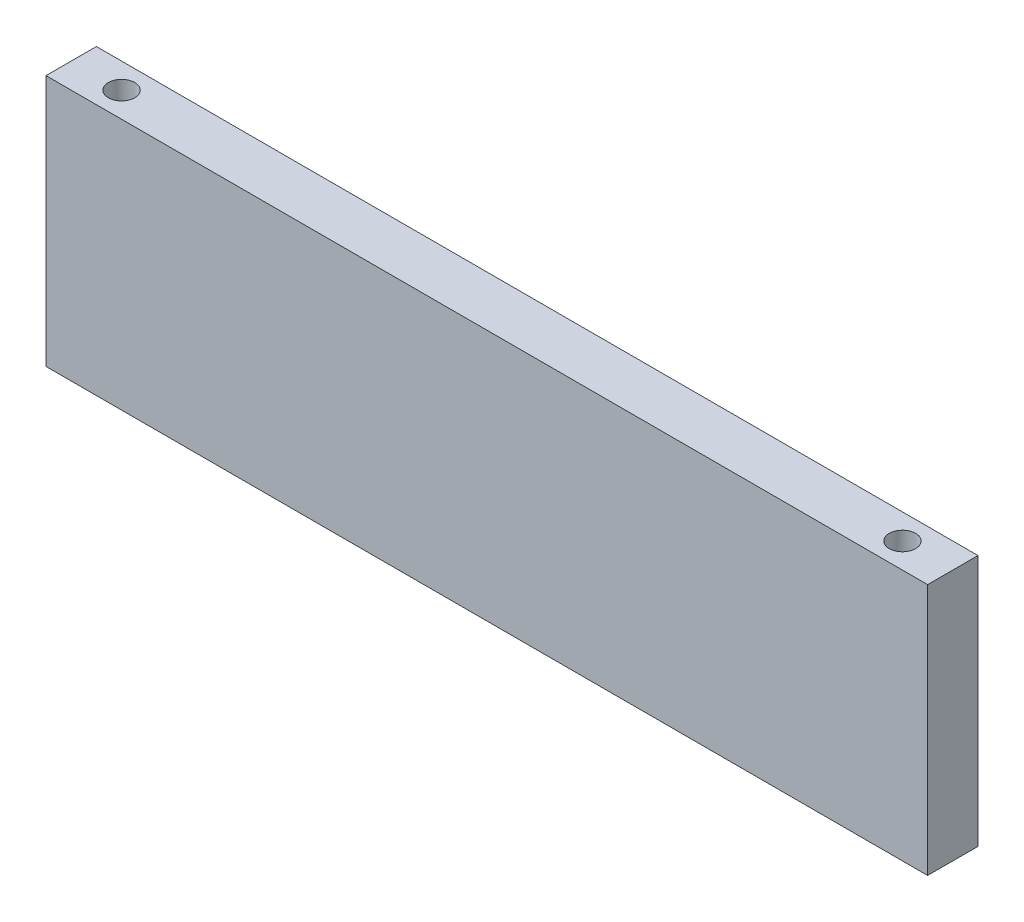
ISO-10303-21;
HEADER;
FILE_DESCRIPTION(('STEP AP214'),'2;1');
FILE_NAME('part.step','',(''),(''),'','','');
FILE_SCHEMA(('AUTOMOTIVE_DESIGN { 1 0 10303 214 1 1 1 1 }'));
ENDSEC;
DATA;
#1=APPLICATION_CONTEXT('core data for automotive mechanical design processes');
#2=APPLICATION_PROTOCOL_DEFINITION('international standard','automotive_design',2000,#1);
#3=PRODUCT_CONTEXT('',#1,'mechanical');
#4=PRODUCT('Part','Part','',(#3));
#5=PRODUCT_RELATED_PRODUCT_CATEGORY('part','',(#4));
#6=PRODUCT_DEFINITION_FORMATION('','',#4);
#7=PRODUCT_DEFINITION_CONTEXT('part definition',#1,'design');
#8=PRODUCT_DEFINITION('design','',#6,#7);
#9=PRODUCT_DEFINITION_SHAPE('','',#8);
#10=(LENGTH_UNIT() NAMED_UNIT(*) SI_UNIT(.MILLI.,.METRE.));
#11=(NAMED_UNIT(*) PLANE_ANGLE_UNIT() SI_UNIT($,.RADIAN.));
#12=(NAMED_UNIT(*) SI_UNIT($,.STERADIAN.) SOLID_ANGLE_UNIT());
#13=UNCERTAINTY_MEASURE_WITH_UNIT(LENGTH_MEASURE(1.E-05),#10,'distance_accuracy_value','');
#14=(GEOMETRIC_REPRESENTATION_CONTEXT(3) GLOBAL_UNCERTAINTY_ASSIGNED_CONTEXT((#13)) GLOBAL_UNIT_ASSIGNED_CONTEXT((#10,
#11,#12)) REPRESENTATION_CONTEXT('',''));
#15=CARTESIAN_POINT('',(0.,0.,0.));
#16=DIRECTION('',(0.,0.,1.));
#17=DIRECTION('',(1.,0.,0.));
#18=AXIS2_PLACEMENT_3D('',#15,#16,#17);
#19=CARTESIAN_POINT('',(0.,0.,8.));
#20=DIRECTION('',(1.,0.,0.));
#21=DIRECTION('',(0.,0.,-1.));
#22=AXIS2_PLACEMENT_3D('',#19,#20,#21);
#23=PLANE('',#22);
#24=DIRECTION('',(0.,-1.,0.));
#25=VECTOR('',#24,1.);
#26=CARTESIAN_POINT('',(0.,0.,0.));
#27=LINE('',#26,#25);
#28=CARTESIAN_POINT('',(0.,40.,0.));
#29=VERTEX_POINT('',#28);
#30=CARTESIAN_POINT('',(0.,0.,0.));
#31=VERTEX_POINT('',#30);
#32=EDGE_CURVE('E131',#29,#31,#27,.T.);
#33=ORIENTED_EDGE('',*,*,#32,.T.);
#34=DIRECTION('',(0.,0.,-1.));
#35=VECTOR('',#34,1.);
#36=CARTESIAN_POINT('',(0.,0.,8.));
#37=LINE('',#36,#35);
#38=CARTESIAN_POINT('',(0.,0.,8.));
#39=VERTEX_POINT('',#38);
#40=EDGE_CURVE('E11',#39,#31,#37,.T.);
#41=ORIENTED_EDGE('',*,*,#40,.F.);
#42=DIRECTION('',(0.,-1.,0.));
#43=VECTOR('',#42,1.);
#44=CARTESIAN_POINT('',(0.,0.,8.));
#45=LINE('',#44,#43);
#46=CARTESIAN_POINT('',(0.,40.,8.));
#47=VERTEX_POINT('',#46);
#48=EDGE_CURVE('E132',#47,#39,#45,.T.);
#49=ORIENTED_EDGE('',*,*,#48,.F.);
#50=DIRECTION('',(0.,0.,-1.));
#51=VECTOR('',#50,1.);
#52=CARTESIAN_POINT('',(0.,40.,8.));
#53=LINE('',#52,#51);
#54=EDGE_CURVE('E138',#47,#29,#53,.T.);
#55=ORIENTED_EDGE('',*,*,#54,.T.);
#56=EDGE_LOOP('',(#33,#41,#49,#55));
#57=FACE_BOUND('',#56,.T.);
#58=ADVANCED_FACE('F38',(#57),#23,.F.);
#59=CARTESIAN_POINT('',(0.,0.,8.));
#60=DIRECTION('',(0.,1.,0.));
#61=DIRECTION('',(0.,0.,1.));
#62=AXIS2_PLACEMENT_3D('',#59,#60,#61);
#63=PLANE('',#62);
#64=CARTESIAN_POINT('',(8.00000000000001,0.,4.));
#65=DIRECTION('',(0.,-1.,0.));
#66=DIRECTION('',(0.,0.,-1.));
#67=AXIS2_PLACEMENT_3D('',#64,#65,#66);
#68=CIRCLE('',#67,2.09999999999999);
#69=CARTESIAN_POINT('',(8.00000000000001,0.,1.90000000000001));
#70=VERTEX_POINT('',#69);
#71=EDGE_CURVE('E119',#70,#70,#68,.T.);
#72=ORIENTED_EDGE('',*,*,#71,.F.);
#73=EDGE_LOOP('',(#72));
#74=FACE_BOUND('',#73,.T.);
#75=CARTESIAN_POINT('',(132.,0.,4.));
#76=DIRECTION('',(0.,-1.,0.));
#77=DIRECTION('',(0.,0.,-1.));
#78=AXIS2_PLACEMENT_3D('',#75,#76,#77);
#79=CIRCLE('',#78,2.09999999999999);
#80=CARTESIAN_POINT('',(132.,0.,1.90000000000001));
#81=VERTEX_POINT('',#80);
#82=EDGE_CURVE('E125',#81,#81,#79,.T.);
#83=ORIENTED_EDGE('',*,*,#82,.F.);
#84=EDGE_LOOP('',(#83));
#85=FACE_BOUND('',#84,.T.);
#86=DIRECTION('',(1.,0.,0.));
#87=VECTOR('',#86,1.);
#88=CARTESIAN_POINT('',(0.,0.,0.));
#89=LINE('',#88,#87);
#90=CARTESIAN_POINT('',(140.,0.,0.));
#91=VERTEX_POINT('',#90);
#92=EDGE_CURVE('E141',#31,#91,#89,.T.);
#93=ORIENTED_EDGE('',*,*,#92,.T.);
#94=DIRECTION('',(0.,0.,-1.));
#95=VECTOR('',#94,1.);
#96=CARTESIAN_POINT('',(140.,0.,8.));
#97=LINE('',#96,#95);
#98=CARTESIAN_POINT('',(140.,0.,8.));
#99=VERTEX_POINT('',#98);
#100=EDGE_CURVE('E46',#99,#91,#97,.T.);
#101=ORIENTED_EDGE('',*,*,#100,.F.);
#102=DIRECTION('',(1.,0.,0.));
#103=VECTOR('',#102,1.);
#104=CARTESIAN_POINT('',(0.,0.,8.));
#105=LINE('',#104,#103);
#106=EDGE_CURVE('E85',#39,#99,#105,.T.);
#107=ORIENTED_EDGE('',*,*,#106,.F.);
#108=ORIENTED_EDGE('',*,*,#40,.T.);
#109=EDGE_LOOP('',(#93,#101,#107,#108));
#110=FACE_BOUND('',#109,.T.);
#111=ADVANCED_FACE('F165',(#74,#85,#110),#63,.F.);
#112=CARTESIAN_POINT('',(140.,0.,8.));
#113=DIRECTION('',(-1.,0.,0.));
#114=DIRECTION('',(0.,0.,1.));
#115=AXIS2_PLACEMENT_3D('',#112,#113,#114);
#116=PLANE('',#115);
#117=DIRECTION('',(0.,1.,0.));
#118=VECTOR('',#117,1.);
#119=CARTESIAN_POINT('',(140.,0.,0.));
#120=LINE('',#119,#118);
#121=CARTESIAN_POINT('',(140.,40.,0.));
#122=VERTEX_POINT('',#121);
#123=EDGE_CURVE('E72',#91,#122,#120,.T.);
#124=ORIENTED_EDGE('',*,*,#123,.T.);
#125=DIRECTION('',(0.,0.,-1.));
#126=VECTOR('',#125,1.);
#127=CARTESIAN_POINT('',(140.,40.,8.));
#128=LINE('',#127,#126);
#129=CARTESIAN_POINT('',(140.,40.,8.));
#130=VERTEX_POINT('',#129);
#131=EDGE_CURVE('E146',#130,#122,#128,.T.);
#132=ORIENTED_EDGE('',*,*,#131,.F.);
#133=DIRECTION('',(0.,1.,0.));
#134=VECTOR('',#133,1.);
#135=CARTESIAN_POINT('',(140.,0.,8.));
#136=LINE('',#135,#134);
#137=EDGE_CURVE('E135',#99,#130,#136,.T.);
#138=ORIENTED_EDGE('',*,*,#137,.F.);
#139=ORIENTED_EDGE('',*,*,#100,.T.);
#140=EDGE_LOOP('',(#124,#132,#138,#139));
#141=FACE_BOUND('',#140,.T.);
#142=ADVANCED_FACE('F148',(#141),#116,.F.);
#143=CARTESIAN_POINT('',(0.,40.,8.));
#144=DIRECTION('',(0.,-1.,0.));
#145=DIRECTION('',(0.,0.,-1.));
#146=AXIS2_PLACEMENT_3D('',#143,#144,#145);
#147=PLANE('',#146);
#148=CARTESIAN_POINT('',(132.,40.,4.00000000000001));
#149=DIRECTION('',(0.,1.,0.));
#150=DIRECTION('',(0.,0.,1.));
#151=AXIS2_PLACEMENT_3D('',#148,#149,#150);
#152=CIRCLE('',#151,2.09999999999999);
#153=CARTESIAN_POINT('',(132.,40.,6.1));
#154=VERTEX_POINT('',#153);
#155=EDGE_CURVE('E109',#154,#154,#152,.T.);
#156=ORIENTED_EDGE('',*,*,#155,.F.);
#157=EDGE_LOOP('',(#156));
#158=FACE_BOUND('',#157,.T.);
#159=CARTESIAN_POINT('',(8.00000000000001,40.,4.00000000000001));
#160=DIRECTION('',(0.,1.,0.));
#161=DIRECTION('',(0.,0.,1.));
#162=AXIS2_PLACEMENT_3D('',#159,#160,#161);
#163=CIRCLE('',#162,2.09999999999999);
#164=CARTESIAN_POINT('',(8.00000000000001,40.,6.1));
#165=VERTEX_POINT('',#164);
#166=EDGE_CURVE('E108',#165,#165,#163,.T.);
#167=ORIENTED_EDGE('',*,*,#166,.F.);
#168=EDGE_LOOP('',(#167));
#169=FACE_BOUND('',#168,.T.);
#170=DIRECTION('',(-1.,0.,0.));
#171=VECTOR('',#170,1.);
#172=CARTESIAN_POINT('',(0.,40.,0.));
#173=LINE('',#172,#171);
#174=EDGE_CURVE('E78',#122,#29,#173,.T.);
#175=ORIENTED_EDGE('',*,*,#174,.T.);
#176=ORIENTED_EDGE('',*,*,#54,.F.);
#177=DIRECTION('',(-1.,0.,0.));
#178=VECTOR('',#177,1.);
#179=CARTESIAN_POINT('',(0.,40.,8.));
#180=LINE('',#179,#178);
#181=EDGE_CURVE('E54',#130,#47,#180,.T.);
#182=ORIENTED_EDGE('',*,*,#181,.F.);
#183=ORIENTED_EDGE('',*,*,#131,.T.);
#184=EDGE_LOOP('',(#175,#176,#182,#183));
#185=FACE_BOUND('',#184,.T.);
#186=ADVANCED_FACE('F155',(#158,#169,#185),#147,.F.);
#187=CARTESIAN_POINT('',(0.,0.,8.));
#188=DIRECTION('',(0.,0.,-1.));
#189=DIRECTION('',(-1.,0.,0.));
#190=AXIS2_PLACEMENT_3D('',#187,#188,#189);
#191=PLANE('',#190);
#192=ORIENTED_EDGE('',*,*,#48,.T.);
#193=ORIENTED_EDGE('',*,*,#106,.T.);
#194=ORIENTED_EDGE('',*,*,#137,.T.);
#195=ORIENTED_EDGE('',*,*,#181,.T.);
#196=EDGE_LOOP('',(#192,#193,#194,#195));
#197=FACE_BOUND('',#196,.T.);
#198=ADVANCED_FACE('F157',(#197),#191,.F.);
#199=CARTESIAN_POINT('',(0.,0.,0.));
#200=DIRECTION('',(0.,0.,-1.));
#201=DIRECTION('',(-1.,0.,0.));
#202=AXIS2_PLACEMENT_3D('',#199,#200,#201);
#203=PLANE('',#202);
#204=ORIENTED_EDGE('',*,*,#32,.F.);
#205=ORIENTED_EDGE('',*,*,#174,.F.);
#206=ORIENTED_EDGE('',*,*,#123,.F.);
#207=ORIENTED_EDGE('',*,*,#92,.F.);
#208=EDGE_LOOP('',(#204,#205,#206,#207));
#209=FACE_BOUND('',#208,.T.);
#210=ADVANCED_FACE('F151',(#209),#203,.T.);
#211=CARTESIAN_POINT('',(132.,14.,4.));
#212=DIRECTION('',(0.,-1.,0.));
#213=DIRECTION('',(0.,0.,-1.));
#214=AXIS2_PLACEMENT_3D('',#211,#212,#213);
#215=CONICAL_SURFACE('',#214,2.09999999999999,1.02974425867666);
#216=CARTESIAN_POINT('',(132.,15.2618072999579,4.));
#217=VERTEX_POINT('',#216);
#218=VERTEX_LOOP('',#217);
#219=FACE_BOUND('',#218,.T.);
#220=CARTESIAN_POINT('',(132.,14.,4.));
#221=DIRECTION('',(0.,-1.,0.));
#222=DIRECTION('',(0.,0.,-1.));
#223=AXIS2_PLACEMENT_3D('',#220,#221,#222);
#224=CIRCLE('',#223,2.09999999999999);
#225=CARTESIAN_POINT('',(132.,14.,1.90000000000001));
#226=VERTEX_POINT('',#225);
#227=EDGE_CURVE('E128',#226,#226,#224,.T.);
#228=ORIENTED_EDGE('',*,*,#227,.T.);
#229=EDGE_LOOP('',(#228));
#230=FACE_BOUND('',#229,.T.);
#231=ADVANCED_FACE('F184',(#219,#230),#215,.F.);
#232=CARTESIAN_POINT('',(132.,0.,4.));
#233=DIRECTION('',(0.,-1.,0.));
#234=DIRECTION('',(0.,0.,-1.));
#235=AXIS2_PLACEMENT_3D('',#232,#233,#234);
#236=CYLINDRICAL_SURFACE('',#235,2.09999999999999);
#237=ORIENTED_EDGE('',*,*,#227,.F.);
#238=EDGE_LOOP('',(#237));
#239=FACE_BOUND('',#238,.T.);
#240=ORIENTED_EDGE('',*,*,#82,.T.);
#241=EDGE_LOOP('',(#240));
#242=FACE_BOUND('',#241,.T.);
#243=ADVANCED_FACE('F181',(#239,#242),#236,.F.);
#244=CARTESIAN_POINT('',(8.00000000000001,14.,4.));
#245=DIRECTION('',(0.,-1.,0.));
#246=DIRECTION('',(0.,0.,-1.));
#247=AXIS2_PLACEMENT_3D('',#244,#245,#246);
#248=CONICAL_SURFACE('',#247,2.09999999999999,1.02974425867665);
#249=CARTESIAN_POINT('',(8.,15.2618072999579,4.));
#250=VERTEX_POINT('',#249);
#251=VERTEX_LOOP('',#250);
#252=FACE_BOUND('',#251,.T.);
#253=CARTESIAN_POINT('',(8.00000000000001,14.,4.));
#254=DIRECTION('',(0.,-1.,0.));
#255=DIRECTION('',(0.,0.,-1.));
#256=AXIS2_PLACEMENT_3D('',#253,#254,#255);
#257=CIRCLE('',#256,2.09999999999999);
#258=CARTESIAN_POINT('',(8.00000000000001,14.,1.90000000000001));
#259=VERTEX_POINT('',#258);
#260=EDGE_CURVE('E122',#259,#259,#257,.T.);
#261=ORIENTED_EDGE('',*,*,#260,.T.);
#262=EDGE_LOOP('',(#261));
#263=FACE_BOUND('',#262,.T.);
#264=ADVANCED_FACE('F183',(#252,#263),#248,.F.);
#265=CARTESIAN_POINT('',(8.00000000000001,0.,4.));
#266=DIRECTION('',(0.,-1.,0.));
#267=DIRECTION('',(0.,0.,-1.));
#268=AXIS2_PLACEMENT_3D('',#265,#266,#267);
#269=CYLINDRICAL_SURFACE('',#268,2.09999999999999);
#270=ORIENTED_EDGE('',*,*,#260,.F.);
#271=EDGE_LOOP('',(#270));
#272=FACE_BOUND('',#271,.T.);
#273=ORIENTED_EDGE('',*,*,#71,.T.);
#274=EDGE_LOOP('',(#273));
#275=FACE_BOUND('',#274,.T.);
#276=ADVANCED_FACE('F191',(#272,#275),#269,.F.);
#277=CARTESIAN_POINT('',(8.00000000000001,26.,4.00000000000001));
#278=DIRECTION('',(0.,1.,0.));
#279=DIRECTION('',(0.,0.,1.));
#280=AXIS2_PLACEMENT_3D('',#277,#278,#279);
#281=CONICAL_SURFACE('',#280,2.09999999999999,1.02974425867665);
#282=CARTESIAN_POINT('',(8.,24.7381927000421,4.00000000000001));
#283=VERTEX_POINT('',#282);
#284=VERTEX_LOOP('',#283);
#285=FACE_BOUND('',#284,.T.);
#286=CARTESIAN_POINT('',(8.00000000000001,26.,4.00000000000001));
#287=DIRECTION('',(0.,1.,0.));
#288=DIRECTION('',(0.,0.,1.));
#289=AXIS2_PLACEMENT_3D('',#286,#287,#288);
#290=CIRCLE('',#289,2.09999999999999);
#291=CARTESIAN_POINT('',(8.00000000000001,26.,6.1));
#292=VERTEX_POINT('',#291);
#293=EDGE_CURVE('E112',#292,#292,#290,.T.);
#294=ORIENTED_EDGE('',*,*,#293,.T.);
#295=EDGE_LOOP('',(#294));
#296=FACE_BOUND('',#295,.T.);
#297=ADVANCED_FACE('F232',(#285,#296),#281,.F.);
#298=CARTESIAN_POINT('',(8.00000000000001,40.,4.00000000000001));
#299=DIRECTION('',(0.,1.,0.));
#300=DIRECTION('',(0.,0.,1.));
#301=AXIS2_PLACEMENT_3D('',#298,#299,#300);
#302=CYLINDRICAL_SURFACE('',#301,2.09999999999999);
#303=ORIENTED_EDGE('',*,*,#293,.F.);
#304=EDGE_LOOP('',(#303));
#305=FACE_BOUND('',#304,.T.);
#306=ORIENTED_EDGE('',*,*,#166,.T.);
#307=EDGE_LOOP('',(#306));
#308=FACE_BOUND('',#307,.T.);
#309=ADVANCED_FACE('F102',(#305,#308),#302,.F.);
#310=CARTESIAN_POINT('',(132.,26.,4.00000000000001));
#311=DIRECTION('',(0.,1.,0.));
#312=DIRECTION('',(0.,0.,1.));
#313=AXIS2_PLACEMENT_3D('',#310,#311,#312);
#314=CONICAL_SURFACE('',#313,2.09999999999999,1.02974425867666);
#315=CARTESIAN_POINT('',(132.,24.7381927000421,4.00000000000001));
#316=VERTEX_POINT('',#315);
#317=VERTEX_LOOP('',#316);
#318=FACE_BOUND('',#317,.T.);
#319=CARTESIAN_POINT('',(132.,26.,4.00000000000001));
#320=DIRECTION('',(0.,1.,0.));
#321=DIRECTION('',(0.,0.,1.));
#322=AXIS2_PLACEMENT_3D('',#319,#320,#321);
#323=CIRCLE('',#322,2.09999999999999);
#324=CARTESIAN_POINT('',(132.,26.,6.1));
#325=VERTEX_POINT('',#324);
#326=EDGE_CURVE('E106',#325,#325,#323,.T.);
#327=ORIENTED_EDGE('',*,*,#326,.T.);
#328=EDGE_LOOP('',(#327));
#329=FACE_BOUND('',#328,.T.);
#330=ADVANCED_FACE('F98',(#318,#329),#314,.F.);
#331=CARTESIAN_POINT('',(132.,40.,4.00000000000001));
#332=DIRECTION('',(0.,1.,0.));
#333=DIRECTION('',(0.,0.,1.));
#334=AXIS2_PLACEMENT_3D('',#331,#332,#333);
#335=CYLINDRICAL_SURFACE('',#334,2.09999999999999);
#336=ORIENTED_EDGE('',*,*,#326,.F.);
#337=EDGE_LOOP('',(#336));
#338=FACE_BOUND('',#337,.T.);
#339=ORIENTED_EDGE('',*,*,#155,.T.);
#340=EDGE_LOOP('',(#339));
#341=FACE_BOUND('',#340,.T.);
#342=ADVANCED_FACE('F101',(#338,#341),#335,.F.);
#343=CLOSED_SHELL('',(#58,#111,#142,#186,#198,#210,#231,#243,#264,#276,#297,#309,#330,#342));
#344=MANIFOLD_SOLID_BREP('B2',#343);
#345=ADVANCED_BREP_SHAPE_REPRESENTATION('',(#18,#344),#14);
#346=SHAPE_DEFINITION_REPRESENTATION(#9,#345);
ENDSEC;
END-ISO-10303-21;
